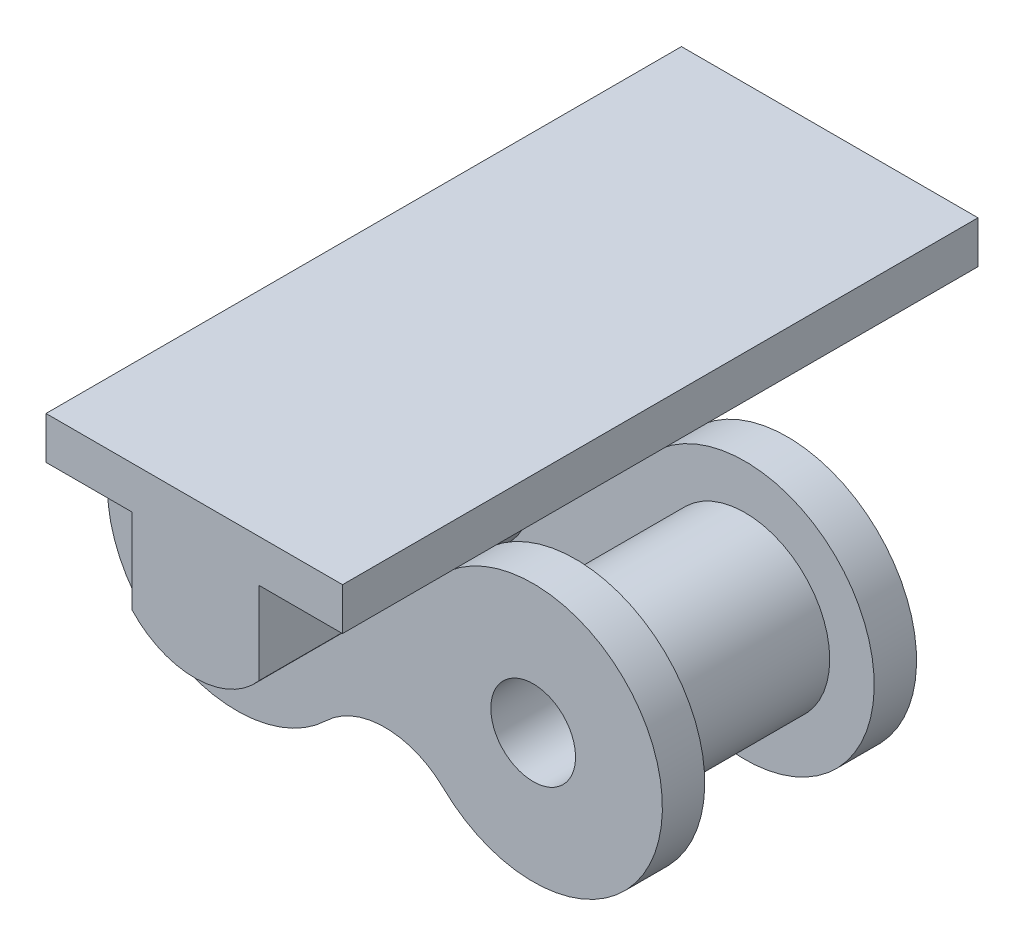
from build123d import *

# Parameters (mm, degrees)
CROQUIS1_R                   = 2
SALIENTE_EXTRUIR1_DEPTH      = 2
CROQUIS2_R                   = 4
CROQUIS2_R_2                 = 2
SALIENTE_EXTRUIR2_DEPTH      = 8
SALIENTE_EXTRUIR3_DEPTH      = 9
SALIENTE_EXTRUIR3_DEPTH_BACK = 21


with BuildPart() as part:
    # Croquis1 → Saliente-Extruir1 (new body)
    with BuildSketch(Plane.XY):
        with BuildLine():
            ThreePointArc((-2.772277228, 4.397312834), (-13.1, 0), (-2.772277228, -4.397312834))
            ThreePointArc((-2.772277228, -4.397312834), (0, -3.28079666), (2.772277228, -4.397312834))
            ThreePointArc((2.772277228, -4.397312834), (13.1, 0), (2.772277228, 4.397312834))
            ThreePointArc((2.772277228, 4.397312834), (0, 3.28079666), (-2.772277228, 4.397312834))
        make_face()
        with Locations((-7, 0)):
            Circle(CROQUIS1_R, mode=Mode.SUBTRACT)
        with Locations(Location((7, 0, 0), (0, 0, 180))):
            Circle(CROQUIS1_R, mode=Mode.SUBTRACT)
    saliente_extruir1 = extrude(amount=SALIENTE_EXTRUIR1_DEPTH)

    # Croquis2 → Saliente-Extruir2 (add)
    # profile 1 of 2: a face of its own
    with BuildSketch(Plane.XY.offset(2)):
        with Locations((-7, 0)):
            Circle(CROQUIS2_R)
        with Locations((-7, 0)):
            Circle(CROQUIS2_R_2, mode=Mode.SUBTRACT)
    # profile 2 of 2: a face of its own
    with BuildSketch(Plane.XY.offset(2)):
        with Locations((7, 0)):
            Circle(CROQUIS2_R)
        with Locations(Location((7, 0, 0), (0, 0, 180))):
            Circle(CROQUIS2_R_2, mode=Mode.SUBTRACT)
    extrude(amount=SALIENTE_EXTRUIR2_DEPTH)

    # Simetr_a1: Saliente-Extruir1 across plane
    add(saliente_extruir1.mirror(Plane.XY.offset(6)))

    # Croquis3 → Saliente-Extruir3 (add, two sides: drawn at the far end of the back side and taken through both)
    with BuildSketch(Plane.XY.offset(12).offset(-SALIENTE_EXTRUIR3_DEPTH_BACK)):
        with BuildLine():
            Line((-2.938536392, 4.551319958), (-2.938536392, 8.551319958))
            Line((-2.938536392, 8.551319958), (-7, 8.551319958))
            Line((-7, 8.551319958), (-7, 10.551319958))
            Line((-7, 10.551319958), (7, 10.551319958))
            Line((7, 10.551319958), (7, 8.551319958))
            Line((7, 8.551319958), (3.061463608, 8.551319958))
            Line((3.061463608, 8.551319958), (3.061463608, 4.658103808))
            ThreePointArc((3.061463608, 4.658103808), (0.085571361, 3.250138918), (-2.938536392, 4.551319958))
        make_face()
    extrude(amount=SALIENTE_EXTRUIR3_DEPTH + SALIENTE_EXTRUIR3_DEPTH_BACK)


solid = part.part
